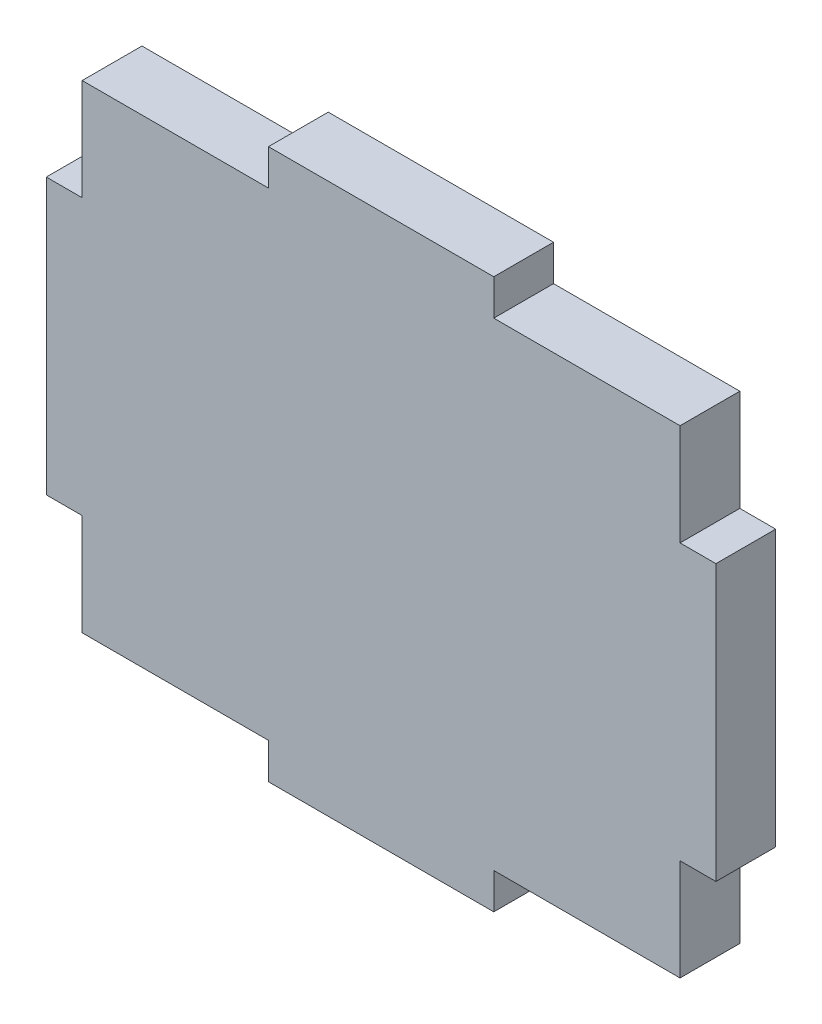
ISO-10303-21;
HEADER;
FILE_DESCRIPTION(('STEP AP214'),'2;1');
FILE_NAME('part.step','',(''),(''),'','','');
FILE_SCHEMA(('AUTOMOTIVE_DESIGN { 1 0 10303 214 1 1 1 1 }'));
ENDSEC;
DATA;
#1=APPLICATION_CONTEXT('core data for automotive mechanical design processes');
#2=APPLICATION_PROTOCOL_DEFINITION('international standard','automotive_design',2000,#1);
#3=PRODUCT_CONTEXT('',#1,'mechanical');
#4=PRODUCT('Part','Part','',(#3));
#5=PRODUCT_RELATED_PRODUCT_CATEGORY('part','',(#4));
#6=PRODUCT_DEFINITION_FORMATION('','',#4);
#7=PRODUCT_DEFINITION_CONTEXT('part definition',#1,'design');
#8=PRODUCT_DEFINITION('design','',#6,#7);
#9=PRODUCT_DEFINITION_SHAPE('','',#8);
#10=(LENGTH_UNIT() NAMED_UNIT(*) SI_UNIT(.MILLI.,.METRE.));
#11=(NAMED_UNIT(*) PLANE_ANGLE_UNIT() SI_UNIT($,.RADIAN.));
#12=(NAMED_UNIT(*) SI_UNIT($,.STERADIAN.) SOLID_ANGLE_UNIT());
#13=UNCERTAINTY_MEASURE_WITH_UNIT(LENGTH_MEASURE(1.E-05),#10,'distance_accuracy_value','');
#14=(GEOMETRIC_REPRESENTATION_CONTEXT(3) GLOBAL_UNCERTAINTY_ASSIGNED_CONTEXT((#13)) GLOBAL_UNIT_ASSIGNED_CONTEXT((#10,
#11,#12)) REPRESENTATION_CONTEXT('',''));
#15=CARTESIAN_POINT('',(0.,0.,0.));
#16=DIRECTION('',(0.,0.,1.));
#17=DIRECTION('',(1.,0.,0.));
#18=AXIS2_PLACEMENT_3D('',#15,#16,#17);
#19=CARTESIAN_POINT('',(50.,23.0204081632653,10.));
#20=DIRECTION('',(-1.,0.,0.));
#21=DIRECTION('',(0.,-1.,0.));
#22=AXIS2_PLACEMENT_3D('',#19,#20,#21);
#23=PLANE('',#22);
#24=DIRECTION('',(0.,1.,0.));
#25=VECTOR('',#24,1.);
#26=CARTESIAN_POINT('',(50.,23.0204081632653,0.));
#27=LINE('',#26,#25);
#28=CARTESIAN_POINT('',(50.,23.0204081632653,0.));
#29=VERTEX_POINT('',#28);
#30=CARTESIAN_POINT('',(50.,40.,0.));
#31=VERTEX_POINT('',#30);
#32=EDGE_CURVE('E202',#29,#31,#27,.T.);
#33=ORIENTED_EDGE('',*,*,#32,.T.);
#34=DIRECTION('',(0.,0.,-1.));
#35=VECTOR('',#34,1.);
#36=CARTESIAN_POINT('',(50.,40.,10.));
#37=LINE('',#36,#35);
#38=CARTESIAN_POINT('',(50.,40.,10.));
#39=VERTEX_POINT('',#38);
#40=EDGE_CURVE('E11',#39,#31,#37,.T.);
#41=ORIENTED_EDGE('',*,*,#40,.F.);
#42=DIRECTION('',(0.,1.,0.));
#43=VECTOR('',#42,1.);
#44=CARTESIAN_POINT('',(50.,23.0204081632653,10.));
#45=LINE('',#44,#43);
#46=CARTESIAN_POINT('',(50.,23.0204081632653,10.));
#47=VERTEX_POINT('',#46);
#48=EDGE_CURVE('E240',#47,#39,#45,.T.);
#49=ORIENTED_EDGE('',*,*,#48,.F.);
#50=DIRECTION('',(0.,0.,-1.));
#51=VECTOR('',#50,1.);
#52=CARTESIAN_POINT('',(50.,23.0204081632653,10.));
#53=LINE('',#52,#51);
#54=EDGE_CURVE('E198',#47,#29,#53,.T.);
#55=ORIENTED_EDGE('',*,*,#54,.T.);
#56=EDGE_LOOP('',(#33,#41,#49,#55));
#57=FACE_BOUND('',#56,.T.);
#58=ADVANCED_FACE('F34',(#57),#23,.F.);
#59=CARTESIAN_POINT('',(18.8424489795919,40.,10.));
#60=DIRECTION('',(0.,-1.,0.));
#61=DIRECTION('',(0.,0.,-1.));
#62=AXIS2_PLACEMENT_3D('',#59,#60,#61);
#63=PLANE('',#62);
#64=DIRECTION('',(-1.,0.,0.));
#65=VECTOR('',#64,1.);
#66=CARTESIAN_POINT('',(18.8424489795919,40.,0.));
#67=LINE('',#66,#65);
#68=CARTESIAN_POINT('',(18.8424489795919,40.,0.));
#69=VERTEX_POINT('',#68);
#70=EDGE_CURVE('E205',#31,#69,#67,.T.);
#71=ORIENTED_EDGE('',*,*,#70,.T.);
#72=DIRECTION('',(0.,0.,-1.));
#73=VECTOR('',#72,1.);
#74=CARTESIAN_POINT('',(18.8424489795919,40.,10.));
#75=LINE('',#74,#73);
#76=CARTESIAN_POINT('',(18.8424489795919,40.,10.));
#77=VERTEX_POINT('',#76);
#78=EDGE_CURVE('E42',#77,#69,#75,.T.);
#79=ORIENTED_EDGE('',*,*,#78,.F.);
#80=DIRECTION('',(-1.,0.,0.));
#81=VECTOR('',#80,1.);
#82=CARTESIAN_POINT('',(18.8424489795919,40.,10.));
#83=LINE('',#82,#81);
#84=EDGE_CURVE('E129',#39,#77,#83,.T.);
#85=ORIENTED_EDGE('',*,*,#84,.F.);
#86=ORIENTED_EDGE('',*,*,#40,.T.);
#87=EDGE_LOOP('',(#71,#79,#85,#86));
#88=FACE_BOUND('',#87,.T.);
#89=ADVANCED_FACE('F358',(#88),#63,.F.);
#90=CARTESIAN_POINT('',(18.8424489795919,40.,10.));
#91=DIRECTION('',(-1.,0.,0.));
#92=DIRECTION('',(0.,-1.,0.));
#93=AXIS2_PLACEMENT_3D('',#90,#91,#92);
#94=PLANE('',#93);
#95=DIRECTION('',(0.,1.,0.));
#96=VECTOR('',#95,1.);
#97=CARTESIAN_POINT('',(18.8424489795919,40.,0.));
#98=LINE('',#97,#96);
#99=CARTESIAN_POINT('',(18.8424489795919,46.,0.));
#100=VERTEX_POINT('',#99);
#101=EDGE_CURVE('E207',#69,#100,#98,.T.);
#102=ORIENTED_EDGE('',*,*,#101,.T.);
#103=DIRECTION('',(0.,0.,-1.));
#104=VECTOR('',#103,1.);
#105=CARTESIAN_POINT('',(18.8424489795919,46.,10.));
#106=LINE('',#105,#104);
#107=CARTESIAN_POINT('',(18.8424489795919,46.,10.));
#108=VERTEX_POINT('',#107);
#109=EDGE_CURVE('E283',#108,#100,#106,.T.);
#110=ORIENTED_EDGE('',*,*,#109,.F.);
#111=DIRECTION('',(0.,1.,0.));
#112=VECTOR('',#111,1.);
#113=CARTESIAN_POINT('',(18.8424489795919,40.,10.));
#114=LINE('',#113,#112);
#115=EDGE_CURVE('E291',#77,#108,#114,.T.);
#116=ORIENTED_EDGE('',*,*,#115,.F.);
#117=ORIENTED_EDGE('',*,*,#78,.T.);
#118=EDGE_LOOP('',(#102,#110,#116,#117));
#119=FACE_BOUND('',#118,.T.);
#120=ADVANCED_FACE('F289',(#119),#94,.F.);
#121=CARTESIAN_POINT('',(-18.8424489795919,46.,10.));
#122=DIRECTION('',(0.,-1.,0.));
#123=DIRECTION('',(0.,0.,-1.));
#124=AXIS2_PLACEMENT_3D('',#121,#122,#123);
#125=PLANE('',#124);
#126=DIRECTION('',(-1.,0.,0.));
#127=VECTOR('',#126,1.);
#128=CARTESIAN_POINT('',(-18.8424489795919,46.,0.));
#129=LINE('',#128,#127);
#130=CARTESIAN_POINT('',(-18.8424489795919,46.,0.));
#131=VERTEX_POINT('',#130);
#132=EDGE_CURVE('E209',#100,#131,#129,.T.);
#133=ORIENTED_EDGE('',*,*,#132,.T.);
#134=DIRECTION('',(0.,0.,-1.));
#135=VECTOR('',#134,1.);
#136=CARTESIAN_POINT('',(-18.8424489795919,46.,10.));
#137=LINE('',#136,#135);
#138=CARTESIAN_POINT('',(-18.8424489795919,46.,10.));
#139=VERTEX_POINT('',#138);
#140=EDGE_CURVE('E280',#139,#131,#137,.T.);
#141=ORIENTED_EDGE('',*,*,#140,.F.);
#142=DIRECTION('',(-1.,0.,0.));
#143=VECTOR('',#142,1.);
#144=CARTESIAN_POINT('',(-18.8424489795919,46.,10.));
#145=LINE('',#144,#143);
#146=EDGE_CURVE('E309',#108,#139,#145,.T.);
#147=ORIENTED_EDGE('',*,*,#146,.F.);
#148=ORIENTED_EDGE('',*,*,#109,.T.);
#149=EDGE_LOOP('',(#133,#141,#147,#148));
#150=FACE_BOUND('',#149,.T.);
#151=ADVANCED_FACE('F300',(#150),#125,.F.);
#152=CARTESIAN_POINT('',(-18.8424489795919,40.,10.));
#153=DIRECTION('',(1.,0.,0.));
#154=DIRECTION('',(0.,0.,-1.));
#155=AXIS2_PLACEMENT_3D('',#152,#153,#154);
#156=PLANE('',#155);
#157=DIRECTION('',(0.,-1.,0.));
#158=VECTOR('',#157,1.);
#159=CARTESIAN_POINT('',(-18.8424489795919,40.,0.));
#160=LINE('',#159,#158);
#161=CARTESIAN_POINT('',(-18.8424489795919,40.,0.));
#162=VERTEX_POINT('',#161);
#163=EDGE_CURVE('E211',#131,#162,#160,.T.);
#164=ORIENTED_EDGE('',*,*,#163,.T.);
#165=DIRECTION('',(0.,0.,-1.));
#166=VECTOR('',#165,1.);
#167=CARTESIAN_POINT('',(-18.8424489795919,40.,10.));
#168=LINE('',#167,#166);
#169=CARTESIAN_POINT('',(-18.8424489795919,40.,10.));
#170=VERTEX_POINT('',#169);
#171=EDGE_CURVE('E277',#170,#162,#168,.T.);
#172=ORIENTED_EDGE('',*,*,#171,.F.);
#173=DIRECTION('',(0.,-1.,0.));
#174=VECTOR('',#173,1.);
#175=CARTESIAN_POINT('',(-18.8424489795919,40.,10.));
#176=LINE('',#175,#174);
#177=EDGE_CURVE('E306',#139,#170,#176,.T.);
#178=ORIENTED_EDGE('',*,*,#177,.F.);
#179=ORIENTED_EDGE('',*,*,#140,.T.);
#180=EDGE_LOOP('',(#164,#172,#178,#179));
#181=FACE_BOUND('',#180,.T.);
#182=ADVANCED_FACE('F304',(#181),#156,.F.);
#183=CARTESIAN_POINT('',(-50.,40.,10.));
#184=DIRECTION('',(0.,-1.,0.));
#185=DIRECTION('',(0.,0.,-1.));
#186=AXIS2_PLACEMENT_3D('',#183,#184,#185);
#187=PLANE('',#186);
#188=DIRECTION('',(-1.,0.,0.));
#189=VECTOR('',#188,1.);
#190=CARTESIAN_POINT('',(-50.,40.,0.));
#191=LINE('',#190,#189);
#192=CARTESIAN_POINT('',(-50.,40.,0.));
#193=VERTEX_POINT('',#192);
#194=EDGE_CURVE('E213',#162,#193,#191,.T.);
#195=ORIENTED_EDGE('',*,*,#194,.T.);
#196=DIRECTION('',(0.,0.,-1.));
#197=VECTOR('',#196,1.);
#198=CARTESIAN_POINT('',(-50.,40.,10.));
#199=LINE('',#198,#197);
#200=CARTESIAN_POINT('',(-50.,40.,10.));
#201=VERTEX_POINT('',#200);
#202=EDGE_CURVE('E274',#201,#193,#199,.T.);
#203=ORIENTED_EDGE('',*,*,#202,.F.);
#204=DIRECTION('',(-1.,0.,0.));
#205=VECTOR('',#204,1.);
#206=CARTESIAN_POINT('',(-50.,40.,10.));
#207=LINE('',#206,#205);
#208=EDGE_CURVE('E308',#170,#201,#207,.T.);
#209=ORIENTED_EDGE('',*,*,#208,.F.);
#210=ORIENTED_EDGE('',*,*,#171,.T.);
#211=EDGE_LOOP('',(#195,#203,#209,#210));
#212=FACE_BOUND('',#211,.T.);
#213=ADVANCED_FACE('F371',(#212),#187,.F.);
#214=CARTESIAN_POINT('',(-50.,23.0204081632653,10.));
#215=DIRECTION('',(1.,0.,0.));
#216=DIRECTION('',(0.,0.,-1.));
#217=AXIS2_PLACEMENT_3D('',#214,#215,#216);
#218=PLANE('',#217);
#219=DIRECTION('',(0.,-1.,0.));
#220=VECTOR('',#219,1.);
#221=CARTESIAN_POINT('',(-50.,23.0204081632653,0.));
#222=LINE('',#221,#220);
#223=CARTESIAN_POINT('',(-50.,23.0204081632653,0.));
#224=VERTEX_POINT('',#223);
#225=EDGE_CURVE('E215',#193,#224,#222,.T.);
#226=ORIENTED_EDGE('',*,*,#225,.T.);
#227=DIRECTION('',(0.,0.,-1.));
#228=VECTOR('',#227,1.);
#229=CARTESIAN_POINT('',(-50.,23.0204081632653,10.));
#230=LINE('',#229,#228);
#231=CARTESIAN_POINT('',(-50.,23.0204081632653,10.));
#232=VERTEX_POINT('',#231);
#233=EDGE_CURVE('E271',#232,#224,#230,.T.);
#234=ORIENTED_EDGE('',*,*,#233,.F.);
#235=DIRECTION('',(0.,-1.,0.));
#236=VECTOR('',#235,1.);
#237=CARTESIAN_POINT('',(-50.,23.0204081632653,10.));
#238=LINE('',#237,#236);
#239=EDGE_CURVE('E311',#201,#232,#238,.T.);
#240=ORIENTED_EDGE('',*,*,#239,.F.);
#241=ORIENTED_EDGE('',*,*,#202,.T.);
#242=EDGE_LOOP('',(#226,#234,#240,#241));
#243=FACE_BOUND('',#242,.T.);
#244=ADVANCED_FACE('F374',(#243),#218,.F.);
#245=CARTESIAN_POINT('',(-56.,23.0204081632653,10.));
#246=DIRECTION('',(0.,-1.,0.));
#247=DIRECTION('',(1.,0.,0.));
#248=AXIS2_PLACEMENT_3D('',#245,#246,#247);
#249=PLANE('',#248);
#250=DIRECTION('',(-1.,0.,0.));
#251=VECTOR('',#250,1.);
#252=CARTESIAN_POINT('',(-56.,23.0204081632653,0.));
#253=LINE('',#252,#251);
#254=CARTESIAN_POINT('',(-56.,23.0204081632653,0.));
#255=VERTEX_POINT('',#254);
#256=EDGE_CURVE('E217',#224,#255,#253,.T.);
#257=ORIENTED_EDGE('',*,*,#256,.T.);
#258=DIRECTION('',(0.,0.,-1.));
#259=VECTOR('',#258,1.);
#260=CARTESIAN_POINT('',(-56.,23.0204081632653,10.));
#261=LINE('',#260,#259);
#262=CARTESIAN_POINT('',(-56.,23.0204081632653,10.));
#263=VERTEX_POINT('',#262);
#264=EDGE_CURVE('E268',#263,#255,#261,.T.);
#265=ORIENTED_EDGE('',*,*,#264,.F.);
#266=DIRECTION('',(-1.,0.,0.));
#267=VECTOR('',#266,1.);
#268=CARTESIAN_POINT('',(-56.,23.0204081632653,10.));
#269=LINE('',#268,#267);
#270=EDGE_CURVE('E317',#232,#263,#269,.T.);
#271=ORIENTED_EDGE('',*,*,#270,.F.);
#272=ORIENTED_EDGE('',*,*,#233,.T.);
#273=EDGE_LOOP('',(#257,#265,#271,#272));
#274=FACE_BOUND('',#273,.T.);
#275=ADVANCED_FACE('F378',(#274),#249,.F.);
#276=CARTESIAN_POINT('',(-56.,-23.0204081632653,10.));
#277=DIRECTION('',(1.,0.,0.));
#278=DIRECTION('',(0.,0.,-1.));
#279=AXIS2_PLACEMENT_3D('',#276,#277,#278);
#280=PLANE('',#279);
#281=DIRECTION('',(0.,-1.,0.));
#282=VECTOR('',#281,1.);
#283=CARTESIAN_POINT('',(-56.,-23.0204081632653,0.));
#284=LINE('',#283,#282);
#285=CARTESIAN_POINT('',(-56.,-23.0204081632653,0.));
#286=VERTEX_POINT('',#285);
#287=EDGE_CURVE('E219',#255,#286,#284,.T.);
#288=ORIENTED_EDGE('',*,*,#287,.T.);
#289=DIRECTION('',(0.,0.,-1.));
#290=VECTOR('',#289,1.);
#291=CARTESIAN_POINT('',(-56.,-23.0204081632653,10.));
#292=LINE('',#291,#290);
#293=CARTESIAN_POINT('',(-56.,-23.0204081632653,10.));
#294=VERTEX_POINT('',#293);
#295=EDGE_CURVE('E265',#294,#286,#292,.T.);
#296=ORIENTED_EDGE('',*,*,#295,.F.);
#297=DIRECTION('',(0.,-1.,0.));
#298=VECTOR('',#297,1.);
#299=CARTESIAN_POINT('',(-56.,-23.0204081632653,10.));
#300=LINE('',#299,#298);
#301=EDGE_CURVE('E319',#263,#294,#300,.T.);
#302=ORIENTED_EDGE('',*,*,#301,.F.);
#303=ORIENTED_EDGE('',*,*,#264,.T.);
#304=EDGE_LOOP('',(#288,#296,#302,#303));
#305=FACE_BOUND('',#304,.T.);
#306=ADVANCED_FACE('F382',(#305),#280,.F.);
#307=CARTESIAN_POINT('',(-56.,-23.0204081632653,10.));
#308=DIRECTION('',(0.,1.,0.));
#309=DIRECTION('',(0.,0.,1.));
#310=AXIS2_PLACEMENT_3D('',#307,#308,#309);
#311=PLANE('',#310);
#312=DIRECTION('',(1.,0.,0.));
#313=VECTOR('',#312,1.);
#314=CARTESIAN_POINT('',(-56.,-23.0204081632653,0.));
#315=LINE('',#314,#313);
#316=CARTESIAN_POINT('',(-50.,-23.0204081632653,0.));
#317=VERTEX_POINT('',#316);
#318=EDGE_CURVE('E221',#286,#317,#315,.T.);
#319=ORIENTED_EDGE('',*,*,#318,.T.);
#320=DIRECTION('',(0.,0.,-1.));
#321=VECTOR('',#320,1.);
#322=CARTESIAN_POINT('',(-50.,-23.0204081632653,10.));
#323=LINE('',#322,#321);
#324=CARTESIAN_POINT('',(-50.,-23.0204081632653,10.));
#325=VERTEX_POINT('',#324);
#326=EDGE_CURVE('E262',#325,#317,#323,.T.);
#327=ORIENTED_EDGE('',*,*,#326,.F.);
#328=DIRECTION('',(1.,0.,0.));
#329=VECTOR('',#328,1.);
#330=CARTESIAN_POINT('',(-56.,-23.0204081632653,10.));
#331=LINE('',#330,#329);
#332=EDGE_CURVE('E321',#294,#325,#331,.T.);
#333=ORIENTED_EDGE('',*,*,#332,.F.);
#334=ORIENTED_EDGE('',*,*,#295,.T.);
#335=EDGE_LOOP('',(#319,#327,#333,#334));
#336=FACE_BOUND('',#335,.T.);
#337=ADVANCED_FACE('F386',(#336),#311,.F.);
#338=CARTESIAN_POINT('',(-50.,-40.,10.));
#339=DIRECTION('',(1.,0.,0.));
#340=DIRECTION('',(0.,0.,-1.));
#341=AXIS2_PLACEMENT_3D('',#338,#339,#340);
#342=PLANE('',#341);
#343=DIRECTION('',(0.,-1.,0.));
#344=VECTOR('',#343,1.);
#345=CARTESIAN_POINT('',(-50.,-40.,0.));
#346=LINE('',#345,#344);
#347=CARTESIAN_POINT('',(-50.,-40.,0.));
#348=VERTEX_POINT('',#347);
#349=EDGE_CURVE('E223',#317,#348,#346,.T.);
#350=ORIENTED_EDGE('',*,*,#349,.T.);
#351=DIRECTION('',(0.,0.,-1.));
#352=VECTOR('',#351,1.);
#353=CARTESIAN_POINT('',(-50.,-40.,10.));
#354=LINE('',#353,#352);
#355=CARTESIAN_POINT('',(-50.,-40.,10.));
#356=VERTEX_POINT('',#355);
#357=EDGE_CURVE('E259',#356,#348,#354,.T.);
#358=ORIENTED_EDGE('',*,*,#357,.F.);
#359=DIRECTION('',(0.,-1.,0.));
#360=VECTOR('',#359,1.);
#361=CARTESIAN_POINT('',(-50.,-40.,10.));
#362=LINE('',#361,#360);
#363=EDGE_CURVE('E323',#325,#356,#362,.T.);
#364=ORIENTED_EDGE('',*,*,#363,.F.);
#365=ORIENTED_EDGE('',*,*,#326,.T.);
#366=EDGE_LOOP('',(#350,#358,#364,#365));
#367=FACE_BOUND('',#366,.T.);
#368=ADVANCED_FACE('F390',(#367),#342,.F.);
#369=CARTESIAN_POINT('',(-50.,-40.,10.));
#370=DIRECTION('',(0.,1.,0.));
#371=DIRECTION('',(0.,0.,1.));
#372=AXIS2_PLACEMENT_3D('',#369,#370,#371);
#373=PLANE('',#372);
#374=DIRECTION('',(1.,0.,0.));
#375=VECTOR('',#374,1.);
#376=CARTESIAN_POINT('',(-50.,-40.,0.));
#377=LINE('',#376,#375);
#378=CARTESIAN_POINT('',(-18.8424489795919,-40.,0.));
#379=VERTEX_POINT('',#378);
#380=EDGE_CURVE('E225',#348,#379,#377,.T.);
#381=ORIENTED_EDGE('',*,*,#380,.T.);
#382=DIRECTION('',(0.,0.,-1.));
#383=VECTOR('',#382,1.);
#384=CARTESIAN_POINT('',(-18.8424489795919,-40.,10.));
#385=LINE('',#384,#383);
#386=CARTESIAN_POINT('',(-18.8424489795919,-40.,10.));
#387=VERTEX_POINT('',#386);
#388=EDGE_CURVE('E256',#387,#379,#385,.T.);
#389=ORIENTED_EDGE('',*,*,#388,.F.);
#390=DIRECTION('',(1.,0.,0.));
#391=VECTOR('',#390,1.);
#392=CARTESIAN_POINT('',(-50.,-40.,10.));
#393=LINE('',#392,#391);
#394=EDGE_CURVE('E325',#356,#387,#393,.T.);
#395=ORIENTED_EDGE('',*,*,#394,.F.);
#396=ORIENTED_EDGE('',*,*,#357,.T.);
#397=EDGE_LOOP('',(#381,#389,#395,#396));
#398=FACE_BOUND('',#397,.T.);
#399=ADVANCED_FACE('F394',(#398),#373,.F.);
#400=CARTESIAN_POINT('',(-18.8424489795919,-40.,10.));
#401=DIRECTION('',(1.,0.,0.));
#402=DIRECTION('',(0.,0.,-1.));
#403=AXIS2_PLACEMENT_3D('',#400,#401,#402);
#404=PLANE('',#403);
#405=DIRECTION('',(0.,-1.,0.));
#406=VECTOR('',#405,1.);
#407=CARTESIAN_POINT('',(-18.8424489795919,-40.,0.));
#408=LINE('',#407,#406);
#409=CARTESIAN_POINT('',(-18.8424489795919,-46.,0.));
#410=VERTEX_POINT('',#409);
#411=EDGE_CURVE('E227',#379,#410,#408,.T.);
#412=ORIENTED_EDGE('',*,*,#411,.T.);
#413=DIRECTION('',(0.,0.,-1.));
#414=VECTOR('',#413,1.);
#415=CARTESIAN_POINT('',(-18.8424489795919,-46.,10.));
#416=LINE('',#415,#414);
#417=CARTESIAN_POINT('',(-18.8424489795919,-46.,10.));
#418=VERTEX_POINT('',#417);
#419=EDGE_CURVE('E253',#418,#410,#416,.T.);
#420=ORIENTED_EDGE('',*,*,#419,.F.);
#421=DIRECTION('',(0.,-1.,0.));
#422=VECTOR('',#421,1.);
#423=CARTESIAN_POINT('',(-18.8424489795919,-40.,10.));
#424=LINE('',#423,#422);
#425=EDGE_CURVE('E327',#387,#418,#424,.T.);
#426=ORIENTED_EDGE('',*,*,#425,.F.);
#427=ORIENTED_EDGE('',*,*,#388,.T.);
#428=EDGE_LOOP('',(#412,#420,#426,#427));
#429=FACE_BOUND('',#428,.T.);
#430=ADVANCED_FACE('F398',(#429),#404,.F.);
#431=CARTESIAN_POINT('',(-18.8424489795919,-46.,10.));
#432=DIRECTION('',(0.,1.,0.));
#433=DIRECTION('',(0.,0.,1.));
#434=AXIS2_PLACEMENT_3D('',#431,#432,#433);
#435=PLANE('',#434);
#436=DIRECTION('',(1.,0.,0.));
#437=VECTOR('',#436,1.);
#438=CARTESIAN_POINT('',(-18.8424489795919,-46.,0.));
#439=LINE('',#438,#437);
#440=CARTESIAN_POINT('',(18.8424489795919,-46.,0.));
#441=VERTEX_POINT('',#440);
#442=EDGE_CURVE('E229',#410,#441,#439,.T.);
#443=ORIENTED_EDGE('',*,*,#442,.T.);
#444=DIRECTION('',(0.,0.,-1.));
#445=VECTOR('',#444,1.);
#446=CARTESIAN_POINT('',(18.8424489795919,-46.,10.));
#447=LINE('',#446,#445);
#448=CARTESIAN_POINT('',(18.8424489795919,-46.,10.));
#449=VERTEX_POINT('',#448);
#450=EDGE_CURVE('E250',#449,#441,#447,.T.);
#451=ORIENTED_EDGE('',*,*,#450,.F.);
#452=DIRECTION('',(1.,0.,0.));
#453=VECTOR('',#452,1.);
#454=CARTESIAN_POINT('',(-18.8424489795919,-46.,10.));
#455=LINE('',#454,#453);
#456=EDGE_CURVE('E329',#418,#449,#455,.T.);
#457=ORIENTED_EDGE('',*,*,#456,.F.);
#458=ORIENTED_EDGE('',*,*,#419,.T.);
#459=EDGE_LOOP('',(#443,#451,#457,#458));
#460=FACE_BOUND('',#459,.T.);
#461=ADVANCED_FACE('F402',(#460),#435,.F.);
#462=CARTESIAN_POINT('',(18.8424489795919,-40.,10.));
#463=DIRECTION('',(-1.,0.,0.));
#464=DIRECTION('',(0.,-1.,0.));
#465=AXIS2_PLACEMENT_3D('',#462,#463,#464);
#466=PLANE('',#465);
#467=DIRECTION('',(0.,1.,0.));
#468=VECTOR('',#467,1.);
#469=CARTESIAN_POINT('',(18.8424489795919,-40.,0.));
#470=LINE('',#469,#468);
#471=CARTESIAN_POINT('',(18.8424489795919,-40.,0.));
#472=VERTEX_POINT('',#471);
#473=EDGE_CURVE('E231',#441,#472,#470,.T.);
#474=ORIENTED_EDGE('',*,*,#473,.T.);
#475=DIRECTION('',(0.,0.,-1.));
#476=VECTOR('',#475,1.);
#477=CARTESIAN_POINT('',(18.8424489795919,-40.,10.));
#478=LINE('',#477,#476);
#479=CARTESIAN_POINT('',(18.8424489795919,-40.,10.));
#480=VERTEX_POINT('',#479);
#481=EDGE_CURVE('E247',#480,#472,#478,.T.);
#482=ORIENTED_EDGE('',*,*,#481,.F.);
#483=DIRECTION('',(0.,1.,0.));
#484=VECTOR('',#483,1.);
#485=CARTESIAN_POINT('',(18.8424489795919,-40.,10.));
#486=LINE('',#485,#484);
#487=EDGE_CURVE('E331',#449,#480,#486,.T.);
#488=ORIENTED_EDGE('',*,*,#487,.F.);
#489=ORIENTED_EDGE('',*,*,#450,.T.);
#490=EDGE_LOOP('',(#474,#482,#488,#489));
#491=FACE_BOUND('',#490,.T.);
#492=ADVANCED_FACE('F406',(#491),#466,.F.);
#493=CARTESIAN_POINT('',(18.8424489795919,-40.,10.));
#494=DIRECTION('',(0.,1.,0.));
#495=DIRECTION('',(0.,0.,1.));
#496=AXIS2_PLACEMENT_3D('',#493,#494,#495);
#497=PLANE('',#496);
#498=DIRECTION('',(1.,0.,0.));
#499=VECTOR('',#498,1.);
#500=CARTESIAN_POINT('',(18.8424489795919,-40.,0.));
#501=LINE('',#500,#499);
#502=CARTESIAN_POINT('',(50.,-40.,0.));
#503=VERTEX_POINT('',#502);
#504=EDGE_CURVE('E233',#472,#503,#501,.T.);
#505=ORIENTED_EDGE('',*,*,#504,.T.);
#506=DIRECTION('',(0.,0.,-1.));
#507=VECTOR('',#506,1.);
#508=CARTESIAN_POINT('',(50.,-40.,10.));
#509=LINE('',#508,#507);
#510=CARTESIAN_POINT('',(50.,-40.,10.));
#511=VERTEX_POINT('',#510);
#512=EDGE_CURVE('E244',#511,#503,#509,.T.);
#513=ORIENTED_EDGE('',*,*,#512,.F.);
#514=DIRECTION('',(1.,0.,0.));
#515=VECTOR('',#514,1.);
#516=CARTESIAN_POINT('',(18.8424489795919,-40.,10.));
#517=LINE('',#516,#515);
#518=EDGE_CURVE('E333',#480,#511,#517,.T.);
#519=ORIENTED_EDGE('',*,*,#518,.F.);
#520=ORIENTED_EDGE('',*,*,#481,.T.);
#521=EDGE_LOOP('',(#505,#513,#519,#520));
#522=FACE_BOUND('',#521,.T.);
#523=ADVANCED_FACE('F339',(#522),#497,.F.);
#524=CARTESIAN_POINT('',(50.,-40.,10.));
#525=DIRECTION('',(-1.,0.,0.));
#526=DIRECTION('',(0.,-1.,0.));
#527=AXIS2_PLACEMENT_3D('',#524,#525,#526);
#528=PLANE('',#527);
#529=DIRECTION('',(0.,1.,0.));
#530=VECTOR('',#529,1.);
#531=CARTESIAN_POINT('',(50.,-40.,0.));
#532=LINE('',#531,#530);
#533=CARTESIAN_POINT('',(50.,-23.0204081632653,0.));
#534=VERTEX_POINT('',#533);
#535=EDGE_CURVE('E235',#503,#534,#532,.T.);
#536=ORIENTED_EDGE('',*,*,#535,.T.);
#537=DIRECTION('',(0.,0.,-1.));
#538=VECTOR('',#537,1.);
#539=CARTESIAN_POINT('',(50.,-23.0204081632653,10.));
#540=LINE('',#539,#538);
#541=CARTESIAN_POINT('',(50.,-23.0204081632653,10.));
#542=VERTEX_POINT('',#541);
#543=EDGE_CURVE('E193',#542,#534,#540,.T.);
#544=ORIENTED_EDGE('',*,*,#543,.F.);
#545=DIRECTION('',(0.,1.,0.));
#546=VECTOR('',#545,1.);
#547=CARTESIAN_POINT('',(50.,-40.,10.));
#548=LINE('',#547,#546);
#549=EDGE_CURVE('E184',#511,#542,#548,.T.);
#550=ORIENTED_EDGE('',*,*,#549,.F.);
#551=ORIENTED_EDGE('',*,*,#512,.T.);
#552=EDGE_LOOP('',(#536,#544,#550,#551));
#553=FACE_BOUND('',#552,.T.);
#554=ADVANCED_FACE('F343',(#553),#528,.F.);
#555=CARTESIAN_POINT('',(56.,-23.0204081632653,10.));
#556=DIRECTION('',(0.,1.,0.));
#557=DIRECTION('',(0.,0.,1.));
#558=AXIS2_PLACEMENT_3D('',#555,#556,#557);
#559=PLANE('',#558);
#560=DIRECTION('',(1.,0.,0.));
#561=VECTOR('',#560,1.);
#562=CARTESIAN_POINT('',(56.,-23.0204081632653,0.));
#563=LINE('',#562,#561);
#564=CARTESIAN_POINT('',(56.,-23.0204081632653,0.));
#565=VERTEX_POINT('',#564);
#566=EDGE_CURVE('E192',#534,#565,#563,.T.);
#567=ORIENTED_EDGE('',*,*,#566,.T.);
#568=DIRECTION('',(0.,0.,-1.));
#569=VECTOR('',#568,1.);
#570=CARTESIAN_POINT('',(56.,-23.0204081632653,10.));
#571=LINE('',#570,#569);
#572=CARTESIAN_POINT('',(56.,-23.0204081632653,10.));
#573=VERTEX_POINT('',#572);
#574=EDGE_CURVE('E189',#573,#565,#571,.T.);
#575=ORIENTED_EDGE('',*,*,#574,.F.);
#576=DIRECTION('',(1.,0.,0.));
#577=VECTOR('',#576,1.);
#578=CARTESIAN_POINT('',(56.,-23.0204081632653,10.));
#579=LINE('',#578,#577);
#580=EDGE_CURVE('E178',#542,#573,#579,.T.);
#581=ORIENTED_EDGE('',*,*,#580,.F.);
#582=ORIENTED_EDGE('',*,*,#543,.T.);
#583=EDGE_LOOP('',(#567,#575,#581,#582));
#584=FACE_BOUND('',#583,.T.);
#585=ADVANCED_FACE('F190',(#584),#559,.F.);
#586=CARTESIAN_POINT('',(56.,-23.0204081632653,10.));
#587=DIRECTION('',(-1.,0.,0.));
#588=DIRECTION('',(0.,0.,1.));
#589=AXIS2_PLACEMENT_3D('',#586,#587,#588);
#590=PLANE('',#589);
#591=DIRECTION('',(0.,1.,0.));
#592=VECTOR('',#591,1.);
#593=CARTESIAN_POINT('',(56.,-23.0204081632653,0.));
#594=LINE('',#593,#592);
#595=CARTESIAN_POINT('',(56.,23.0204081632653,0.));
#596=VERTEX_POINT('',#595);
#597=EDGE_CURVE('E115',#565,#596,#594,.T.);
#598=ORIENTED_EDGE('',*,*,#597,.T.);
#599=DIRECTION('',(0.,0.,-1.));
#600=VECTOR('',#599,1.);
#601=CARTESIAN_POINT('',(56.,23.0204081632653,10.));
#602=LINE('',#601,#600);
#603=CARTESIAN_POINT('',(56.,23.0204081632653,10.));
#604=VERTEX_POINT('',#603);
#605=EDGE_CURVE('E194',#604,#596,#602,.T.);
#606=ORIENTED_EDGE('',*,*,#605,.F.);
#607=DIRECTION('',(0.,1.,0.));
#608=VECTOR('',#607,1.);
#609=CARTESIAN_POINT('',(56.,-23.0204081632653,10.));
#610=LINE('',#609,#608);
#611=EDGE_CURVE('E182',#573,#604,#610,.T.);
#612=ORIENTED_EDGE('',*,*,#611,.F.);
#613=ORIENTED_EDGE('',*,*,#574,.T.);
#614=EDGE_LOOP('',(#598,#606,#612,#613));
#615=FACE_BOUND('',#614,.T.);
#616=ADVANCED_FACE('F196',(#615),#590,.F.);
#617=CARTESIAN_POINT('',(56.,23.0204081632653,10.));
#618=DIRECTION('',(0.,-1.,0.));
#619=DIRECTION('',(1.,0.,0.));
#620=AXIS2_PLACEMENT_3D('',#617,#618,#619);
#621=PLANE('',#620);
#622=DIRECTION('',(-1.,0.,0.));
#623=VECTOR('',#622,1.);
#624=CARTESIAN_POINT('',(56.,23.0204081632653,0.));
#625=LINE('',#624,#623);
#626=EDGE_CURVE('E121',#596,#29,#625,.T.);
#627=ORIENTED_EDGE('',*,*,#626,.T.);
#628=ORIENTED_EDGE('',*,*,#54,.F.);
#629=DIRECTION('',(-1.,0.,0.));
#630=VECTOR('',#629,1.);
#631=CARTESIAN_POINT('',(56.,23.0204081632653,10.));
#632=LINE('',#631,#630);
#633=EDGE_CURVE('E50',#604,#47,#632,.T.);
#634=ORIENTED_EDGE('',*,*,#633,.F.);
#635=ORIENTED_EDGE('',*,*,#605,.T.);
#636=EDGE_LOOP('',(#627,#628,#634,#635));
#637=FACE_BOUND('',#636,.T.);
#638=ADVANCED_FACE('F347',(#637),#621,.F.);
#639=CARTESIAN_POINT('',(0.,0.,10.));
#640=DIRECTION('',(0.,0.,-1.));
#641=DIRECTION('',(-1.,0.,0.));
#642=AXIS2_PLACEMENT_3D('',#639,#640,#641);
#643=PLANE('',#642);
#644=ORIENTED_EDGE('',*,*,#48,.T.);
#645=ORIENTED_EDGE('',*,*,#84,.T.);
#646=ORIENTED_EDGE('',*,*,#115,.T.);
#647=ORIENTED_EDGE('',*,*,#146,.T.);
#648=ORIENTED_EDGE('',*,*,#177,.T.);
#649=ORIENTED_EDGE('',*,*,#208,.T.);
#650=ORIENTED_EDGE('',*,*,#239,.T.);
#651=ORIENTED_EDGE('',*,*,#270,.T.);
#652=ORIENTED_EDGE('',*,*,#301,.T.);
#653=ORIENTED_EDGE('',*,*,#332,.T.);
#654=ORIENTED_EDGE('',*,*,#363,.T.);
#655=ORIENTED_EDGE('',*,*,#394,.T.);
#656=ORIENTED_EDGE('',*,*,#425,.T.);
#657=ORIENTED_EDGE('',*,*,#456,.T.);
#658=ORIENTED_EDGE('',*,*,#487,.T.);
#659=ORIENTED_EDGE('',*,*,#518,.T.);
#660=ORIENTED_EDGE('',*,*,#549,.T.);
#661=ORIENTED_EDGE('',*,*,#580,.T.);
#662=ORIENTED_EDGE('',*,*,#611,.T.);
#663=ORIENTED_EDGE('',*,*,#633,.T.);
#664=EDGE_LOOP('',(#644,#645,#646,#647,#648,#649,#650,#651,#652,#653,#654,#655,#656,#657,#658,
#659,#660,#661,#662,#663));
#665=FACE_BOUND('',#664,.T.);
#666=ADVANCED_FACE('F180',(#665),#643,.F.);
#667=CARTESIAN_POINT('',(0.,0.,0.));
#668=DIRECTION('',(0.,0.,-1.));
#669=DIRECTION('',(-1.,0.,0.));
#670=AXIS2_PLACEMENT_3D('',#667,#668,#669);
#671=PLANE('',#670);
#672=ORIENTED_EDGE('',*,*,#32,.F.);
#673=ORIENTED_EDGE('',*,*,#626,.F.);
#674=ORIENTED_EDGE('',*,*,#597,.F.);
#675=ORIENTED_EDGE('',*,*,#566,.F.);
#676=ORIENTED_EDGE('',*,*,#535,.F.);
#677=ORIENTED_EDGE('',*,*,#504,.F.);
#678=ORIENTED_EDGE('',*,*,#473,.F.);
#679=ORIENTED_EDGE('',*,*,#442,.F.);
#680=ORIENTED_EDGE('',*,*,#411,.F.);
#681=ORIENTED_EDGE('',*,*,#380,.F.);
#682=ORIENTED_EDGE('',*,*,#349,.F.);
#683=ORIENTED_EDGE('',*,*,#318,.F.);
#684=ORIENTED_EDGE('',*,*,#287,.F.);
#685=ORIENTED_EDGE('',*,*,#256,.F.);
#686=ORIENTED_EDGE('',*,*,#225,.F.);
#687=ORIENTED_EDGE('',*,*,#194,.F.);
#688=ORIENTED_EDGE('',*,*,#163,.F.);
#689=ORIENTED_EDGE('',*,*,#132,.F.);
#690=ORIENTED_EDGE('',*,*,#101,.F.);
#691=ORIENTED_EDGE('',*,*,#70,.F.);
#692=EDGE_LOOP('',(#672,#673,#674,#675,#676,#677,#678,#679,#680,#681,#682,#683,#684,#685,#686,
#687,#688,#689,#690,#691));
#693=FACE_BOUND('',#692,.T.);
#694=ADVANCED_FACE('F295',(#693),#671,.T.);
#695=CLOSED_SHELL('',(#58,#89,#120,#151,#182,#213,#244,#275,#306,#337,#368,#399,#430,#461,#492,
#523,#554,#585,#616,#638,#666,#694));
#696=MANIFOLD_SOLID_BREP('B2',#695);
#697=ADVANCED_BREP_SHAPE_REPRESENTATION('',(#18,#696),#14);
#698=SHAPE_DEFINITION_REPRESENTATION(#9,#697);
ENDSEC;
END-ISO-10303-21;
